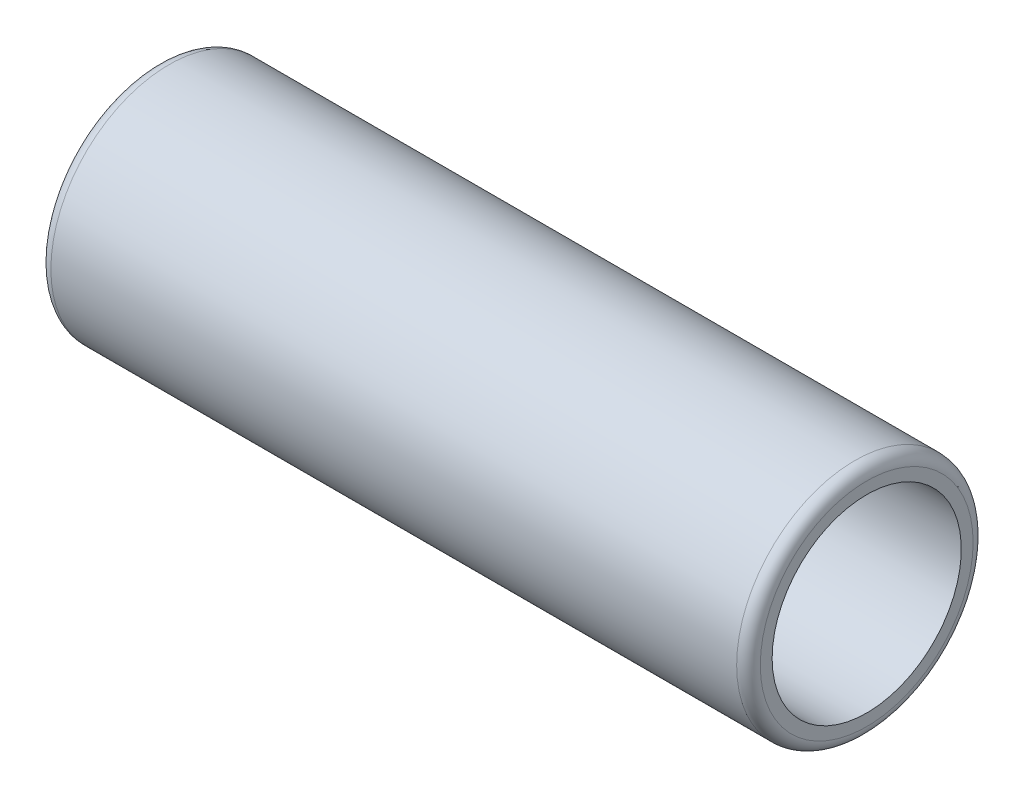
ISO-10303-21;
HEADER;
FILE_DESCRIPTION(('STEP AP214'),'2;1');
FILE_NAME('part.step','',(''),(''),'','','');
FILE_SCHEMA(('AUTOMOTIVE_DESIGN { 1 0 10303 214 1 1 1 1 }'));
ENDSEC;
DATA;
#1=APPLICATION_CONTEXT('core data for automotive mechanical design processes');
#2=APPLICATION_PROTOCOL_DEFINITION('international standard','automotive_design',2000,#1);
#3=PRODUCT_CONTEXT('',#1,'mechanical');
#4=PRODUCT('Part','Part','',(#3));
#5=PRODUCT_RELATED_PRODUCT_CATEGORY('part','',(#4));
#6=PRODUCT_DEFINITION_FORMATION('','',#4);
#7=PRODUCT_DEFINITION_CONTEXT('part definition',#1,'design');
#8=PRODUCT_DEFINITION('design','',#6,#7);
#9=PRODUCT_DEFINITION_SHAPE('','',#8);
#10=(LENGTH_UNIT() NAMED_UNIT(*) SI_UNIT(.MILLI.,.METRE.));
#11=(NAMED_UNIT(*) PLANE_ANGLE_UNIT() SI_UNIT($,.RADIAN.));
#12=(NAMED_UNIT(*) SI_UNIT($,.STERADIAN.) SOLID_ANGLE_UNIT());
#13=UNCERTAINTY_MEASURE_WITH_UNIT(LENGTH_MEASURE(1.E-05),#10,'distance_accuracy_value','');
#14=(GEOMETRIC_REPRESENTATION_CONTEXT(3) GLOBAL_UNCERTAINTY_ASSIGNED_CONTEXT((#13)) GLOBAL_UNIT_ASSIGNED_CONTEXT((#10,
#11,#12)) REPRESENTATION_CONTEXT('',''));
#15=CARTESIAN_POINT('',(0.,0.,0.));
#16=DIRECTION('',(0.,0.,1.));
#17=DIRECTION('',(1.,0.,0.));
#18=AXIS2_PLACEMENT_3D('',#15,#16,#17);
#19=CARTESIAN_POINT('',(0.,0.,0.));
#20=DIRECTION('',(-1.,0.,0.));
#21=DIRECTION('',(0.,0.,1.));
#22=AXIS2_PLACEMENT_3D('',#19,#20,#21);
#23=CYLINDRICAL_SURFACE('',#22,6.);
#24=CARTESIAN_POINT('',(11.,0.,0.));
#25=DIRECTION('',(-1.,0.,0.));
#26=DIRECTION('',(0.,0.,1.));
#27=AXIS2_PLACEMENT_3D('',#24,#25,#26);
#28=CIRCLE('',#27,6.);
#29=CARTESIAN_POINT('',(11.,0.,6.));
#30=VERTEX_POINT('',#29);
#31=EDGE_CURVE('E43',#30,#30,#28,.T.);
#32=ORIENTED_EDGE('',*,*,#31,.F.);
#33=EDGE_LOOP('',(#32));
#34=FACE_BOUND('',#33,.T.);
#35=CARTESIAN_POINT('',(0.,0.,0.));
#36=DIRECTION('',(-1.,0.,0.));
#37=DIRECTION('',(0.,0.,1.));
#38=AXIS2_PLACEMENT_3D('',#35,#36,#37);
#39=CIRCLE('',#38,6.);
#40=CARTESIAN_POINT('',(0.,0.,6.));
#41=VERTEX_POINT('',#40);
#42=EDGE_CURVE('E34',#41,#41,#39,.T.);
#43=ORIENTED_EDGE('',*,*,#42,.T.);
#44=EDGE_LOOP('',(#43));
#45=FACE_BOUND('',#44,.T.);
#46=ADVANCED_FACE('F14',(#34,#45),#23,.F.);
#47=CARTESIAN_POINT('',(0.,6.,0.));
#48=DIRECTION('',(1.,0.,0.));
#49=DIRECTION('',(0.,0.,-1.));
#50=AXIS2_PLACEMENT_3D('',#47,#48,#49);
#51=PLANE('',#50);
#52=CARTESIAN_POINT('',(0.,0.,0.));
#53=DIRECTION('',(1.,0.,0.));
#54=DIRECTION('',(0.,0.,-1.));
#55=AXIS2_PLACEMENT_3D('',#52,#53,#54);
#56=CIRCLE('',#55,9.);
#57=CARTESIAN_POINT('',(0.,0.,-9.));
#58=VERTEX_POINT('',#57);
#59=EDGE_CURVE('E21',#58,#58,#56,.F.);
#60=ORIENTED_EDGE('',*,*,#59,.T.);
#61=EDGE_LOOP('',(#60));
#62=FACE_BOUND('',#61,.T.);
#63=ORIENTED_EDGE('',*,*,#42,.F.);
#64=EDGE_LOOP('',(#63));
#65=FACE_BOUND('',#64,.T.);
#66=ADVANCED_FACE('F51',(#62,#65),#51,.F.);
#67=CARTESIAN_POINT('',(0.,0.,0.));
#68=DIRECTION('',(-1.,0.,0.));
#69=DIRECTION('',(0.,0.,1.));
#70=AXIS2_PLACEMENT_3D('',#67,#68,#69);
#71=CYLINDRICAL_SURFACE('',#70,10.);
#72=CARTESIAN_POINT('',(1.,0.,0.));
#73=DIRECTION('',(1.,0.,0.));
#74=DIRECTION('',(0.,0.,-1.));
#75=AXIS2_PLACEMENT_3D('',#72,#73,#74);
#76=CIRCLE('',#75,10.);
#77=CARTESIAN_POINT('',(1.,0.,-10.));
#78=VERTEX_POINT('',#77);
#79=EDGE_CURVE('E9',#78,#78,#76,.T.);
#80=ORIENTED_EDGE('',*,*,#79,.T.);
#81=EDGE_LOOP('',(#80));
#82=FACE_BOUND('',#81,.T.);
#83=CARTESIAN_POINT('',(59.,0.,0.));
#84=DIRECTION('',(-1.,0.,0.));
#85=DIRECTION('',(0.,0.,1.));
#86=AXIS2_PLACEMENT_3D('',#83,#84,#85);
#87=CIRCLE('',#86,10.);
#88=CARTESIAN_POINT('',(59.,0.,10.));
#89=VERTEX_POINT('',#88);
#90=EDGE_CURVE('E29',#89,#89,#87,.T.);
#91=ORIENTED_EDGE('',*,*,#90,.T.);
#92=EDGE_LOOP('',(#91));
#93=FACE_BOUND('',#92,.T.);
#94=ADVANCED_FACE('F56',(#82,#93),#71,.T.);
#95=CARTESIAN_POINT('',(60.,10.,0.));
#96=DIRECTION('',(-1.,0.,0.));
#97=DIRECTION('',(0.,0.,1.));
#98=AXIS2_PLACEMENT_3D('',#95,#96,#97);
#99=PLANE('',#98);
#100=CARTESIAN_POINT('',(60.,0.,0.));
#101=DIRECTION('',(-1.,0.,0.));
#102=DIRECTION('',(0.,0.,1.));
#103=AXIS2_PLACEMENT_3D('',#100,#101,#102);
#104=CIRCLE('',#103,9.);
#105=CARTESIAN_POINT('',(60.,0.,9.));
#106=VERTEX_POINT('',#105);
#107=EDGE_CURVE('E25',#106,#106,#104,.F.);
#108=ORIENTED_EDGE('',*,*,#107,.T.);
#109=EDGE_LOOP('',(#108));
#110=FACE_BOUND('',#109,.T.);
#111=CARTESIAN_POINT('',(60.,0.,0.));
#112=DIRECTION('',(-1.,0.,0.));
#113=DIRECTION('',(0.,0.,1.));
#114=AXIS2_PLACEMENT_3D('',#111,#112,#113);
#115=CIRCLE('',#114,8.);
#116=CARTESIAN_POINT('',(60.,0.,8.));
#117=VERTEX_POINT('',#116);
#118=EDGE_CURVE('E37',#117,#117,#115,.T.);
#119=ORIENTED_EDGE('',*,*,#118,.T.);
#120=EDGE_LOOP('',(#119));
#121=FACE_BOUND('',#120,.T.);
#122=ADVANCED_FACE('F63',(#110,#121),#99,.F.);
#123=CARTESIAN_POINT('',(0.,0.,0.));
#124=DIRECTION('',(-1.,0.,0.));
#125=DIRECTION('',(0.,0.,1.));
#126=AXIS2_PLACEMENT_3D('',#123,#124,#125);
#127=CYLINDRICAL_SURFACE('',#126,8.);
#128=ORIENTED_EDGE('',*,*,#118,.F.);
#129=EDGE_LOOP('',(#128));
#130=FACE_BOUND('',#129,.T.);
#131=CARTESIAN_POINT('',(13.,0.,0.));
#132=DIRECTION('',(-1.,0.,0.));
#133=DIRECTION('',(0.,0.,1.));
#134=AXIS2_PLACEMENT_3D('',#131,#132,#133);
#135=CIRCLE('',#134,8.);
#136=CARTESIAN_POINT('',(13.,0.,8.));
#137=VERTEX_POINT('',#136);
#138=EDGE_CURVE('E40',#137,#137,#135,.T.);
#139=ORIENTED_EDGE('',*,*,#138,.T.);
#140=EDGE_LOOP('',(#139));
#141=FACE_BOUND('',#140,.T.);
#142=ADVANCED_FACE('F75',(#130,#141),#127,.F.);
#143=CARTESIAN_POINT('',(11.,0.,0.));
#144=DIRECTION('',(1.,0.,0.));
#145=DIRECTION('',(0.,0.,-1.));
#146=AXIS2_PLACEMENT_3D('',#143,#144,#145);
#147=CONICAL_SURFACE('',#146,6.,0.785398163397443);
#148=ORIENTED_EDGE('',*,*,#138,.F.);
#149=EDGE_LOOP('',(#148));
#150=FACE_BOUND('',#149,.T.);
#151=ORIENTED_EDGE('',*,*,#31,.T.);
#152=EDGE_LOOP('',(#151));
#153=FACE_BOUND('',#152,.T.);
#154=ADVANCED_FACE('F47',(#150,#153),#147,.F.);
#155=CARTESIAN_POINT('',(59.,0.,0.));
#156=DIRECTION('',(-1.,0.,0.));
#157=DIRECTION('',(0.,0.,1.));
#158=AXIS2_PLACEMENT_3D('',#155,#156,#157);
#159=TOROIDAL_SURFACE('',#158,9.,1.);
#160=ORIENTED_EDGE('',*,*,#107,.F.);
#161=EDGE_LOOP('',(#160));
#162=FACE_BOUND('',#161,.T.);
#163=ORIENTED_EDGE('',*,*,#90,.F.);
#164=EDGE_LOOP('',(#163));
#165=FACE_BOUND('',#164,.T.);
#166=ADVANCED_FACE('F66',(#162,#165),#159,.T.);
#167=CARTESIAN_POINT('',(1.,0.,0.));
#168=DIRECTION('',(1.,0.,0.));
#169=DIRECTION('',(0.,0.,-1.));
#170=AXIS2_PLACEMENT_3D('',#167,#168,#169);
#171=TOROIDAL_SURFACE('',#170,9.,1.);
#172=ORIENTED_EDGE('',*,*,#79,.F.);
#173=EDGE_LOOP('',(#172));
#174=FACE_BOUND('',#173,.T.);
#175=ORIENTED_EDGE('',*,*,#59,.F.);
#176=EDGE_LOOP('',(#175));
#177=FACE_BOUND('',#176,.T.);
#178=ADVANCED_FACE('F16',(#174,#177),#171,.T.);
#179=CLOSED_SHELL('',(#46,#66,#94,#122,#142,#154,#166,#178));
#180=MANIFOLD_SOLID_BREP('B1',#179);
#181=ADVANCED_BREP_SHAPE_REPRESENTATION('',(#18,#180),#14);
#182=SHAPE_DEFINITION_REPRESENTATION(#9,#181);
ENDSEC;
END-ISO-10303-21;
